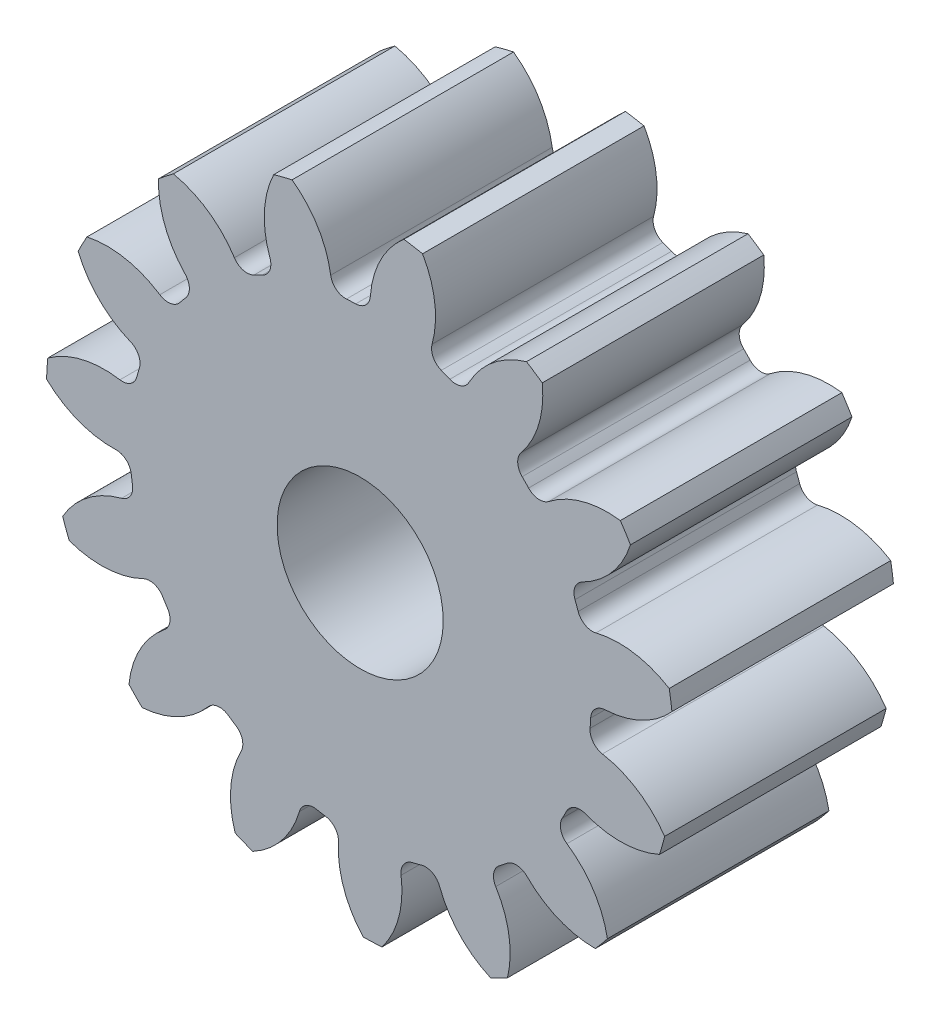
from build123d import *

# Parameters (mm, degrees)
SKETCH3_R         = 143.933333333
GEARBODY_DEPTH    = 101.6
TOOTHCUT_DEPTH    = 228.499821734
CIRPATTERN1_COUNT = 15
BOREDIA_R         = 38.1
BORE_DEPTH        = 12700


with BuildPart() as part:
    # Sketch3 → gearBody (new body)
    with BuildSketch(Plane.XY):
        Circle(SKETCH3_R)
    extrude(amount=GEARBODY_DEPTH)

    # Sketch2 → toothCut (cut, through all)
    with BuildSketch(Plane.XY):
        with BuildLine():
            ThreePointArc((105.449826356, -9.001586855), (105.608542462, -6.894215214), (105.725147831, -4.784094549))
            ThreePointArc((105.725147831, -4.784094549), (107.733995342, -0.225039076), (112.290830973, 1.788838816))
            ThreePointArc((112.290830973, 1.788838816), (129.756529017, 6.306971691), (143.933333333, 17.46413765))
            ThreePointArc((143.933333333, 17.46413765), (144.681009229, -9.44489898), (140.441298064, -36.028354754))
            ThreePointArc((140.441298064, -36.028354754), (127.835329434, -23.122786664), (111.105254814, -16.372324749))
            ThreePointArc((111.105254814, -16.372324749), (106.848912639, -13.783115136), (105.449826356, -9.001586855))
        make_face()
    toothcut = extrude(amount=TOOTHCUT_DEPTH, mode=Mode.SUBTRACT)

    # CirPattern1: toothCut ×15 about axis
    cirpattern1_axis = Axis((0, 0, 0), (0, 0, 1))
    for i in range(1, CIRPATTERN1_COUNT):
        add(toothcut.rotate(cirpattern1_axis, i * 360 / CIRPATTERN1_COUNT), mode=Mode.SUBTRACT)

    # boreDia → bore (cut, symmetric)
    with BuildSketch(Plane.XY):
        Circle(BOREDIA_R)
    extrude(amount=BORE_DEPTH, both=True, mode=Mode.SUBTRACT)


solid = part.part
